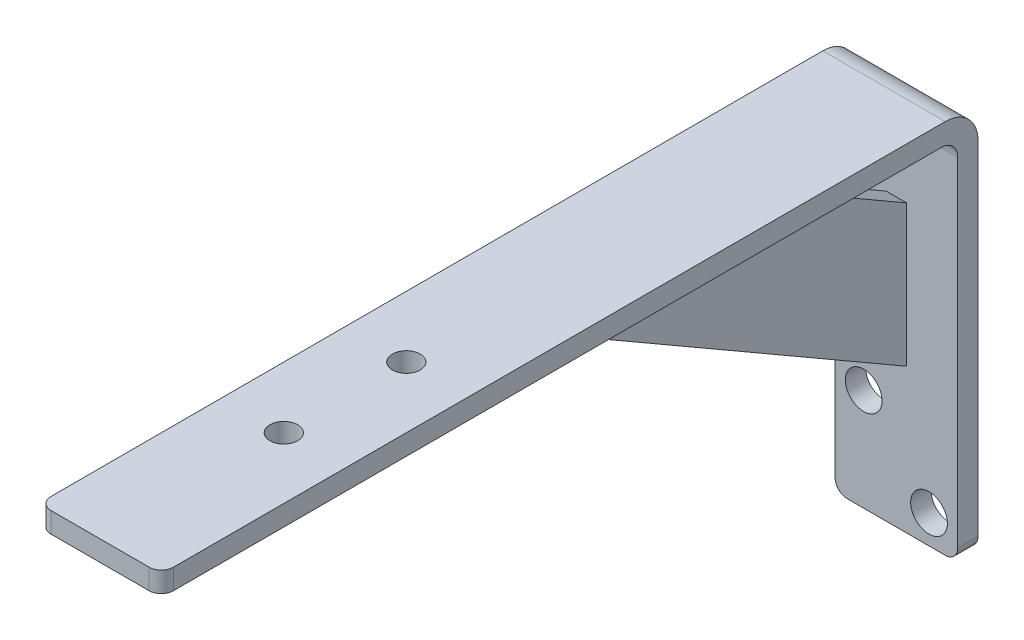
ISO-10303-21;
HEADER;
FILE_DESCRIPTION(('STEP AP214'),'2;1');
FILE_NAME('part.step','',(''),(''),'','','');
FILE_SCHEMA(('AUTOMOTIVE_DESIGN { 1 0 10303 214 1 1 1 1 }'));
ENDSEC;
DATA;
#1=APPLICATION_CONTEXT('core data for automotive mechanical design processes');
#2=APPLICATION_PROTOCOL_DEFINITION('international standard','automotive_design',2000,#1);
#3=PRODUCT_CONTEXT('',#1,'mechanical');
#4=PRODUCT('Part','Part','',(#3));
#5=PRODUCT_RELATED_PRODUCT_CATEGORY('part','',(#4));
#6=PRODUCT_DEFINITION_FORMATION('','',#4);
#7=PRODUCT_DEFINITION_CONTEXT('part definition',#1,'design');
#8=PRODUCT_DEFINITION('design','',#6,#7);
#9=PRODUCT_DEFINITION_SHAPE('','',#8);
#10=(LENGTH_UNIT() NAMED_UNIT(*) SI_UNIT(.MILLI.,.METRE.));
#11=(NAMED_UNIT(*) PLANE_ANGLE_UNIT() SI_UNIT($,.RADIAN.));
#12=(NAMED_UNIT(*) SI_UNIT($,.STERADIAN.) SOLID_ANGLE_UNIT());
#13=UNCERTAINTY_MEASURE_WITH_UNIT(LENGTH_MEASURE(1.E-05),#10,'distance_accuracy_value','');
#14=(GEOMETRIC_REPRESENTATION_CONTEXT(3) GLOBAL_UNCERTAINTY_ASSIGNED_CONTEXT((#13)) GLOBAL_UNIT_ASSIGNED_CONTEXT((#10,
#11,#12)) REPRESENTATION_CONTEXT('',''));
#15=CARTESIAN_POINT('',(0.,0.,0.));
#16=DIRECTION('',(0.,0.,1.));
#17=DIRECTION('',(1.,0.,0.));
#18=AXIS2_PLACEMENT_3D('',#15,#16,#17);
#19=CARTESIAN_POINT('',(30.,5.,195.));
#20=DIRECTION('',(0.,0.,-1.));
#21=DIRECTION('',(-1.,0.,0.));
#22=AXIS2_PLACEMENT_3D('',#19,#20,#21);
#23=PLANE('',#22);
#24=DIRECTION('',(-1.,0.,0.));
#25=VECTOR('',#24,1.);
#26=CARTESIAN_POINT('',(30.,5.,195.));
#27=LINE('',#26,#25);
#28=CARTESIAN_POINT('',(27.,5.,195.));
#29=VERTEX_POINT('',#28);
#30=CARTESIAN_POINT('',(3.,5.,195.));
#31=VERTEX_POINT('',#30);
#32=EDGE_CURVE('E203',#29,#31,#27,.T.);
#33=ORIENTED_EDGE('',*,*,#32,.T.);
#34=DIRECTION('',(0.,-1.,0.));
#35=VECTOR('',#34,1.);
#36=CARTESIAN_POINT('',(3.,5.,195.));
#37=LINE('',#36,#35);
#38=CARTESIAN_POINT('',(3.,0.,195.));
#39=VERTEX_POINT('',#38);
#40=EDGE_CURVE('E253',#31,#39,#37,.T.);
#41=ORIENTED_EDGE('',*,*,#40,.T.);
#42=DIRECTION('',(-1.,0.,0.));
#43=VECTOR('',#42,1.);
#44=CARTESIAN_POINT('',(30.,0.,195.));
#45=LINE('',#44,#43);
#46=CARTESIAN_POINT('',(27.,0.,195.));
#47=VERTEX_POINT('',#46);
#48=EDGE_CURVE('E220',#47,#39,#45,.T.);
#49=ORIENTED_EDGE('',*,*,#48,.F.);
#50=DIRECTION('',(0.,-1.,0.));
#51=VECTOR('',#50,1.);
#52=CARTESIAN_POINT('',(27.,5.,195.));
#53=LINE('',#52,#51);
#54=EDGE_CURVE('E251',#47,#29,#53,.F.);
#55=ORIENTED_EDGE('',*,*,#54,.T.);
#56=EDGE_LOOP('',(#33,#41,#49,#55));
#57=FACE_BOUND('',#56,.T.);
#58=ADVANCED_FACE('F16',(#57),#23,.F.);
#59=CARTESIAN_POINT('',(30.,0.,195.));
#60=DIRECTION('',(0.,1.,0.));
#61=DIRECTION('',(0.,0.,1.));
#62=AXIS2_PLACEMENT_3D('',#59,#60,#61);
#63=PLANE('',#62);
#64=DIRECTION('',(1.,0.,0.));
#65=VECTOR('',#64,1.);
#66=CARTESIAN_POINT('',(12.5,0.,34.6410161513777));
#67=LINE('',#66,#65);
#68=CARTESIAN_POINT('',(12.5,0.,34.6410161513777));
#69=VERTEX_POINT('',#68);
#70=CARTESIAN_POINT('',(17.5,0.,34.6410161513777));
#71=VERTEX_POINT('',#70);
#72=EDGE_CURVE('E141',#69,#71,#67,.T.);
#73=ORIENTED_EDGE('',*,*,#72,.F.);
#74=DIRECTION('',(0.,0.,1.));
#75=VECTOR('',#74,1.);
#76=CARTESIAN_POINT('',(12.5,0.,94.6410161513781));
#77=LINE('',#76,#75);
#78=CARTESIAN_POINT('',(12.5,0.,94.641016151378));
#79=VERTEX_POINT('',#78);
#80=EDGE_CURVE('E135',#69,#79,#77,.T.);
#81=ORIENTED_EDGE('',*,*,#80,.T.);
#82=DIRECTION('',(1.,0.,0.));
#83=VECTOR('',#82,1.);
#84=CARTESIAN_POINT('',(12.5,0.,94.6410161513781));
#85=LINE('',#84,#83);
#86=CARTESIAN_POINT('',(17.5,0.,94.6410161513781));
#87=VERTEX_POINT('',#86);
#88=EDGE_CURVE('E128',#79,#87,#85,.T.);
#89=ORIENTED_EDGE('',*,*,#88,.T.);
#90=DIRECTION('',(0.,0.,1.));
#91=VECTOR('',#90,1.);
#92=CARTESIAN_POINT('',(17.5,0.,94.6410161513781));
#93=LINE('',#92,#91);
#94=EDGE_CURVE('E132',#71,#87,#93,.T.);
#95=ORIENTED_EDGE('',*,*,#94,.F.);
#96=EDGE_LOOP('',(#73,#81,#89,#95));
#97=FACE_BOUND('',#96,.T.);
#98=CARTESIAN_POINT('',(15.,0.,150.));
#99=DIRECTION('',(0.,1.,0.));
#100=DIRECTION('',(0.,0.,1.));
#101=AXIS2_PLACEMENT_3D('',#98,#99,#100);
#102=CIRCLE('',#101,3.4);
#103=CARTESIAN_POINT('',(15.,0.,153.4));
#104=VERTEX_POINT('',#103);
#105=EDGE_CURVE('E186',#104,#104,#102,.T.);
#106=ORIENTED_EDGE('',*,*,#105,.T.);
#107=EDGE_LOOP('',(#106));
#108=FACE_BOUND('',#107,.T.);
#109=CARTESIAN_POINT('',(15.,0.,120.));
#110=DIRECTION('',(0.,1.,0.));
#111=DIRECTION('',(0.,0.,1.));
#112=AXIS2_PLACEMENT_3D('',#109,#110,#111);
#113=CIRCLE('',#112,3.4);
#114=CARTESIAN_POINT('',(15.,0.,123.4));
#115=VERTEX_POINT('',#114);
#116=EDGE_CURVE('E192',#115,#115,#113,.T.);
#117=ORIENTED_EDGE('',*,*,#116,.T.);
#118=EDGE_LOOP('',(#117));
#119=FACE_BOUND('',#118,.T.);
#120=DIRECTION('',(0.,0.,-1.));
#121=VECTOR('',#120,1.);
#122=CARTESIAN_POINT('',(0.,0.,195.));
#123=LINE('',#122,#121);
#124=CARTESIAN_POINT('',(0.,0.,192.));
#125=VERTEX_POINT('',#124);
#126=CARTESIAN_POINT('',(0.,0.,4.));
#127=VERTEX_POINT('',#126);
#128=EDGE_CURVE('E204',#125,#127,#123,.T.);
#129=ORIENTED_EDGE('',*,*,#128,.T.);
#130=DIRECTION('',(-1.,0.,0.));
#131=VECTOR('',#130,1.);
#132=CARTESIAN_POINT('',(30.,0.,4.));
#133=LINE('',#132,#131);
#134=CARTESIAN_POINT('',(30.,0.,4.));
#135=VERTEX_POINT('',#134);
#136=EDGE_CURVE('E268',#127,#135,#133,.F.);
#137=ORIENTED_EDGE('',*,*,#136,.T.);
#138=DIRECTION('',(0.,0.,-1.));
#139=VECTOR('',#138,1.);
#140=CARTESIAN_POINT('',(30.,0.,195.));
#141=LINE('',#140,#139);
#142=CARTESIAN_POINT('',(30.,0.,192.));
#143=VERTEX_POINT('',#142);
#144=EDGE_CURVE('E193',#143,#135,#141,.T.);
#145=ORIENTED_EDGE('',*,*,#144,.F.);
#146=CARTESIAN_POINT('',(27.,0.,192.));
#147=DIRECTION('',(0.,1.,0.));
#148=DIRECTION('',(0.,0.,1.));
#149=AXIS2_PLACEMENT_3D('',#146,#147,#148);
#150=CIRCLE('',#149,3.);
#151=EDGE_CURVE('E256',#143,#47,#150,.F.);
#152=ORIENTED_EDGE('',*,*,#151,.T.);
#153=ORIENTED_EDGE('',*,*,#48,.T.);
#154=CARTESIAN_POINT('',(3.,0.,192.));
#155=DIRECTION('',(0.,1.,0.));
#156=DIRECTION('',(0.,0.,1.));
#157=AXIS2_PLACEMENT_3D('',#154,#155,#156);
#158=CIRCLE('',#157,3.);
#159=EDGE_CURVE('E258',#39,#125,#158,.F.);
#160=ORIENTED_EDGE('',*,*,#159,.T.);
#161=EDGE_LOOP('',(#129,#137,#145,#152,#153,#160));
#162=FACE_BOUND('',#161,.T.);
#163=ADVANCED_FACE('F130',(#97,#108,#119,#162),#63,.F.);
#164=CARTESIAN_POINT('',(30.,0.,0.));
#165=DIRECTION('',(0.,0.,-1.));
#166=DIRECTION('',(0.,1.,0.));
#167=AXIS2_PLACEMENT_3D('',#164,#165,#166);
#168=PLANE('',#167);
#169=DIRECTION('',(1.,0.,0.));
#170=VECTOR('',#169,1.);
#171=CARTESIAN_POINT('',(12.5,-54.6410161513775,0.));
#172=LINE('',#171,#170);
#173=CARTESIAN_POINT('',(12.5,-54.6410161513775,0.));
#174=VERTEX_POINT('',#173);
#175=CARTESIAN_POINT('',(17.5,-54.6410161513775,0.));
#176=VERTEX_POINT('',#175);
#177=EDGE_CURVE('E140',#174,#176,#172,.T.);
#178=ORIENTED_EDGE('',*,*,#177,.F.);
#179=DIRECTION('',(0.,1.,0.));
#180=VECTOR('',#179,1.);
#181=CARTESIAN_POINT('',(12.5,-20.,0.));
#182=LINE('',#181,#180);
#183=CARTESIAN_POINT('',(12.5,-20.,0.));
#184=VERTEX_POINT('',#183);
#185=EDGE_CURVE('E165',#174,#184,#182,.T.);
#186=ORIENTED_EDGE('',*,*,#185,.T.);
#187=DIRECTION('',(1.,0.,0.));
#188=VECTOR('',#187,1.);
#189=CARTESIAN_POINT('',(12.5,-20.,0.));
#190=LINE('',#189,#188);
#191=CARTESIAN_POINT('',(17.5,-20.,0.));
#192=VERTEX_POINT('',#191);
#193=EDGE_CURVE('E167',#184,#192,#190,.T.);
#194=ORIENTED_EDGE('',*,*,#193,.T.);
#195=DIRECTION('',(0.,1.,0.));
#196=VECTOR('',#195,1.);
#197=CARTESIAN_POINT('',(17.5,-20.,0.));
#198=LINE('',#197,#196);
#199=EDGE_CURVE('E154',#176,#192,#198,.T.);
#200=ORIENTED_EDGE('',*,*,#199,.F.);
#201=EDGE_LOOP('',(#178,#186,#194,#200));
#202=FACE_BOUND('',#201,.T.);
#203=CARTESIAN_POINT('',(7.,-65.,0.));
#204=DIRECTION('',(0.,0.,1.));
#205=DIRECTION('',(1.,0.,0.));
#206=AXIS2_PLACEMENT_3D('',#203,#204,#205);
#207=CIRCLE('',#206,4.5);
#208=CARTESIAN_POINT('',(11.5,-65.,0.));
#209=VERTEX_POINT('',#208);
#210=EDGE_CURVE('E174',#209,#209,#207,.T.);
#211=ORIENTED_EDGE('',*,*,#210,.F.);
#212=EDGE_LOOP('',(#211));
#213=FACE_BOUND('',#212,.T.);
#214=CARTESIAN_POINT('',(23.,-83.,0.));
#215=DIRECTION('',(0.,0.,1.));
#216=DIRECTION('',(1.,0.,0.));
#217=AXIS2_PLACEMENT_3D('',#214,#215,#216);
#218=CIRCLE('',#217,4.5);
#219=CARTESIAN_POINT('',(27.5,-83.,0.));
#220=VERTEX_POINT('',#219);
#221=EDGE_CURVE('E180',#220,#220,#218,.T.);
#222=ORIENTED_EDGE('',*,*,#221,.F.);
#223=EDGE_LOOP('',(#222));
#224=FACE_BOUND('',#223,.T.);
#225=DIRECTION('',(0.,-1.,0.));
#226=VECTOR('',#225,1.);
#227=CARTESIAN_POINT('',(30.,0.,0.));
#228=LINE('',#227,#226);
#229=CARTESIAN_POINT('',(30.,-4.,0.));
#230=VERTEX_POINT('',#229);
#231=CARTESIAN_POINT('',(30.,-87.,0.));
#232=VERTEX_POINT('',#231);
#233=EDGE_CURVE('E196',#230,#232,#228,.T.);
#234=ORIENTED_EDGE('',*,*,#233,.F.);
#235=DIRECTION('',(-1.,0.,0.));
#236=VECTOR('',#235,1.);
#237=CARTESIAN_POINT('',(0.,-4.,0.));
#238=LINE('',#237,#236);
#239=CARTESIAN_POINT('',(0.,-4.,0.));
#240=VERTEX_POINT('',#239);
#241=EDGE_CURVE('E265',#230,#240,#238,.T.);
#242=ORIENTED_EDGE('',*,*,#241,.T.);
#243=DIRECTION('',(0.,-1.,0.));
#244=VECTOR('',#243,1.);
#245=CARTESIAN_POINT('',(0.,0.,0.));
#246=LINE('',#245,#244);
#247=CARTESIAN_POINT('',(0.,-87.,0.));
#248=VERTEX_POINT('',#247);
#249=EDGE_CURVE('E207',#240,#248,#246,.T.);
#250=ORIENTED_EDGE('',*,*,#249,.T.);
#251=CARTESIAN_POINT('',(3.,-87.,0.));
#252=DIRECTION('',(0.,0.,-1.));
#253=DIRECTION('',(0.,1.,0.));
#254=AXIS2_PLACEMENT_3D('',#251,#252,#253);
#255=CIRCLE('',#254,3.);
#256=CARTESIAN_POINT('',(3.,-90.,0.));
#257=VERTEX_POINT('',#256);
#258=EDGE_CURVE('E243',#248,#257,#255,.F.);
#259=ORIENTED_EDGE('',*,*,#258,.T.);
#260=DIRECTION('',(-1.,0.,0.));
#261=VECTOR('',#260,1.);
#262=CARTESIAN_POINT('',(30.,-90.,0.));
#263=LINE('',#262,#261);
#264=CARTESIAN_POINT('',(27.,-90.,0.));
#265=VERTEX_POINT('',#264);
#266=EDGE_CURVE('E217',#265,#257,#263,.T.);
#267=ORIENTED_EDGE('',*,*,#266,.F.);
#268=CARTESIAN_POINT('',(27.,-87.,0.));
#269=DIRECTION('',(0.,0.,-1.));
#270=DIRECTION('',(0.,1.,0.));
#271=AXIS2_PLACEMENT_3D('',#268,#269,#270);
#272=CIRCLE('',#271,3.);
#273=EDGE_CURVE('E240',#265,#232,#272,.F.);
#274=ORIENTED_EDGE('',*,*,#273,.T.);
#275=EDGE_LOOP('',(#234,#242,#250,#259,#267,#274));
#276=FACE_BOUND('',#275,.T.);
#277=ADVANCED_FACE('F309',(#202,#213,#224,#276),#168,.F.);
#278=CARTESIAN_POINT('',(30.,-90.,0.));
#279=DIRECTION('',(0.,1.,0.));
#280=DIRECTION('',(0.,0.,1.));
#281=AXIS2_PLACEMENT_3D('',#278,#279,#280);
#282=PLANE('',#281);
#283=ORIENTED_EDGE('',*,*,#266,.T.);
#284=DIRECTION('',(0.,0.,-1.));
#285=VECTOR('',#284,1.);
#286=CARTESIAN_POINT('',(3.,-90.,0.));
#287=LINE('',#286,#285);
#288=CARTESIAN_POINT('',(3.,-90.,-5.));
#289=VERTEX_POINT('',#288);
#290=EDGE_CURVE('E227',#257,#289,#287,.T.);
#291=ORIENTED_EDGE('',*,*,#290,.T.);
#292=DIRECTION('',(-1.,0.,0.));
#293=VECTOR('',#292,1.);
#294=CARTESIAN_POINT('',(30.,-90.,-5.));
#295=LINE('',#294,#293);
#296=CARTESIAN_POINT('',(27.,-90.,-5.));
#297=VERTEX_POINT('',#296);
#298=EDGE_CURVE('E214',#297,#289,#295,.T.);
#299=ORIENTED_EDGE('',*,*,#298,.F.);
#300=DIRECTION('',(0.,0.,-1.));
#301=VECTOR('',#300,1.);
#302=CARTESIAN_POINT('',(27.,-90.,0.));
#303=LINE('',#302,#301);
#304=EDGE_CURVE('E223',#297,#265,#303,.F.);
#305=ORIENTED_EDGE('',*,*,#304,.T.);
#306=EDGE_LOOP('',(#283,#291,#299,#305));
#307=FACE_BOUND('',#306,.T.);
#308=ADVANCED_FACE('F320',(#307),#282,.F.);
#309=CARTESIAN_POINT('',(30.,5.,-5.));
#310=DIRECTION('',(0.,0.,1.));
#311=DIRECTION('',(0.,-1.,0.));
#312=AXIS2_PLACEMENT_3D('',#309,#310,#311);
#313=PLANE('',#312);
#314=CARTESIAN_POINT('',(7.,-65.,-5.));
#315=DIRECTION('',(0.,0.,1.));
#316=DIRECTION('',(1.,0.,0.));
#317=AXIS2_PLACEMENT_3D('',#314,#315,#316);
#318=CIRCLE('',#317,4.5);
#319=CARTESIAN_POINT('',(11.5,-65.,-5.));
#320=VERTEX_POINT('',#319);
#321=EDGE_CURVE('E169',#320,#320,#318,.T.);
#322=ORIENTED_EDGE('',*,*,#321,.T.);
#323=EDGE_LOOP('',(#322));
#324=FACE_BOUND('',#323,.T.);
#325=CARTESIAN_POINT('',(23.,-83.,-5.));
#326=DIRECTION('',(0.,0.,1.));
#327=DIRECTION('',(1.,0.,0.));
#328=AXIS2_PLACEMENT_3D('',#325,#326,#327);
#329=CIRCLE('',#328,4.5);
#330=CARTESIAN_POINT('',(27.5,-83.,-5.));
#331=VERTEX_POINT('',#330);
#332=EDGE_CURVE('E177',#331,#331,#329,.T.);
#333=ORIENTED_EDGE('',*,*,#332,.T.);
#334=EDGE_LOOP('',(#333));
#335=FACE_BOUND('',#334,.T.);
#336=DIRECTION('',(0.,1.,0.));
#337=VECTOR('',#336,1.);
#338=CARTESIAN_POINT('',(0.,5.,-5.));
#339=LINE('',#338,#337);
#340=CARTESIAN_POINT('',(0.,-87.,-5.));
#341=VERTEX_POINT('',#340);
#342=CARTESIAN_POINT('',(0.,-3.,-5.));
#343=VERTEX_POINT('',#342);
#344=EDGE_CURVE('E209',#341,#343,#339,.T.);
#345=ORIENTED_EDGE('',*,*,#344,.T.);
#346=DIRECTION('',(-1.,0.,0.));
#347=VECTOR('',#346,1.);
#348=CARTESIAN_POINT('',(30.,-3.,-5.));
#349=LINE('',#348,#347);
#350=CARTESIAN_POINT('',(30.,-3.,-5.));
#351=VERTEX_POINT('',#350);
#352=EDGE_CURVE('E24',#343,#351,#349,.F.);
#353=ORIENTED_EDGE('',*,*,#352,.T.);
#354=DIRECTION('',(0.,1.,0.));
#355=VECTOR('',#354,1.);
#356=CARTESIAN_POINT('',(30.,5.,-5.));
#357=LINE('',#356,#355);
#358=CARTESIAN_POINT('',(30.,-87.,-5.));
#359=VERTEX_POINT('',#358);
#360=EDGE_CURVE('E199',#359,#351,#357,.T.);
#361=ORIENTED_EDGE('',*,*,#360,.F.);
#362=CARTESIAN_POINT('',(27.,-87.,-5.));
#363=DIRECTION('',(0.,0.,1.));
#364=DIRECTION('',(0.,-1.,0.));
#365=AXIS2_PLACEMENT_3D('',#362,#363,#364);
#366=CIRCLE('',#365,3.);
#367=EDGE_CURVE('E230',#359,#297,#366,.F.);
#368=ORIENTED_EDGE('',*,*,#367,.T.);
#369=ORIENTED_EDGE('',*,*,#298,.T.);
#370=CARTESIAN_POINT('',(3.,-87.,-5.));
#371=DIRECTION('',(0.,0.,1.));
#372=DIRECTION('',(0.,-1.,0.));
#373=AXIS2_PLACEMENT_3D('',#370,#371,#372);
#374=CIRCLE('',#373,3.);
#375=EDGE_CURVE('E232',#289,#341,#374,.F.);
#376=ORIENTED_EDGE('',*,*,#375,.T.);
#377=EDGE_LOOP('',(#345,#353,#361,#368,#369,#376));
#378=FACE_BOUND('',#377,.T.);
#379=ADVANCED_FACE('F317',(#324,#335,#378),#313,.F.);
#380=CARTESIAN_POINT('',(30.,5.,195.));
#381=DIRECTION('',(0.,-1.,0.));
#382=DIRECTION('',(0.,0.,-1.));
#383=AXIS2_PLACEMENT_3D('',#380,#381,#382);
#384=PLANE('',#383);
#385=CARTESIAN_POINT('',(15.,5.,150.));
#386=DIRECTION('',(0.,1.,0.));
#387=DIRECTION('',(0.,0.,1.));
#388=AXIS2_PLACEMENT_3D('',#385,#386,#387);
#389=CIRCLE('',#388,3.4);
#390=CARTESIAN_POINT('',(15.,5.,153.4));
#391=VERTEX_POINT('',#390);
#392=EDGE_CURVE('E183',#391,#391,#389,.T.);
#393=ORIENTED_EDGE('',*,*,#392,.F.);
#394=EDGE_LOOP('',(#393));
#395=FACE_BOUND('',#394,.T.);
#396=CARTESIAN_POINT('',(15.,5.,120.));
#397=DIRECTION('',(0.,1.,0.));
#398=DIRECTION('',(0.,0.,1.));
#399=AXIS2_PLACEMENT_3D('',#396,#397,#398);
#400=CIRCLE('',#399,3.4);
#401=CARTESIAN_POINT('',(15.,5.,123.4));
#402=VERTEX_POINT('',#401);
#403=EDGE_CURVE('E189',#402,#402,#400,.T.);
#404=ORIENTED_EDGE('',*,*,#403,.F.);
#405=EDGE_LOOP('',(#404));
#406=FACE_BOUND('',#405,.T.);
#407=DIRECTION('',(0.,0.,1.));
#408=VECTOR('',#407,1.);
#409=CARTESIAN_POINT('',(30.,5.,195.));
#410=LINE('',#409,#408);
#411=CARTESIAN_POINT('',(30.,5.,3.));
#412=VERTEX_POINT('',#411);
#413=CARTESIAN_POINT('',(30.,5.,192.));
#414=VERTEX_POINT('',#413);
#415=EDGE_CURVE('E201',#412,#414,#410,.T.);
#416=ORIENTED_EDGE('',*,*,#415,.F.);
#417=DIRECTION('',(-1.,0.,0.));
#418=VECTOR('',#417,1.);
#419=CARTESIAN_POINT('',(30.,5.,3.));
#420=LINE('',#419,#418);
#421=CARTESIAN_POINT('',(0.,5.,3.));
#422=VERTEX_POINT('',#421);
#423=EDGE_CURVE('E274',#412,#422,#420,.T.);
#424=ORIENTED_EDGE('',*,*,#423,.T.);
#425=DIRECTION('',(0.,0.,1.));
#426=VECTOR('',#425,1.);
#427=CARTESIAN_POINT('',(0.,5.,195.));
#428=LINE('',#427,#426);
#429=CARTESIAN_POINT('',(0.,5.,192.));
#430=VERTEX_POINT('',#429);
#431=EDGE_CURVE('E197',#422,#430,#428,.T.);
#432=ORIENTED_EDGE('',*,*,#431,.T.);
#433=CARTESIAN_POINT('',(3.,5.,192.));
#434=DIRECTION('',(0.,-1.,0.));
#435=DIRECTION('',(0.,0.,-1.));
#436=AXIS2_PLACEMENT_3D('',#433,#434,#435);
#437=CIRCLE('',#436,3.);
#438=EDGE_CURVE('E263',#430,#31,#437,.F.);
#439=ORIENTED_EDGE('',*,*,#438,.T.);
#440=ORIENTED_EDGE('',*,*,#32,.F.);
#441=CARTESIAN_POINT('',(27.,5.,192.));
#442=DIRECTION('',(0.,-1.,0.));
#443=DIRECTION('',(0.,0.,-1.));
#444=AXIS2_PLACEMENT_3D('',#441,#442,#443);
#445=CIRCLE('',#444,3.);
#446=EDGE_CURVE('E260',#29,#414,#445,.F.);
#447=ORIENTED_EDGE('',*,*,#446,.T.);
#448=EDGE_LOOP('',(#416,#424,#432,#439,#440,#447));
#449=FACE_BOUND('',#448,.T.);
#450=ADVANCED_FACE('F280',(#395,#406,#449),#384,.F.);
#451=CARTESIAN_POINT('',(30.,0.,195.));
#452=DIRECTION('',(1.,0.,0.));
#453=DIRECTION('',(0.,0.,-1.));
#454=AXIS2_PLACEMENT_3D('',#451,#452,#453);
#455=PLANE('',#454);
#456=ORIENTED_EDGE('',*,*,#360,.T.);
#457=CARTESIAN_POINT('',(30.,-3.,3.));
#458=DIRECTION('',(1.,0.,0.));
#459=DIRECTION('',(0.,0.,-1.));
#460=AXIS2_PLACEMENT_3D('',#457,#458,#459);
#461=CIRCLE('',#460,8.);
#462=EDGE_CURVE('E11',#351,#412,#461,.T.);
#463=ORIENTED_EDGE('',*,*,#462,.T.);
#464=ORIENTED_EDGE('',*,*,#415,.T.);
#465=DIRECTION('',(0.,-1.,0.));
#466=VECTOR('',#465,1.);
#467=CARTESIAN_POINT('',(30.,0.,192.));
#468=LINE('',#467,#466);
#469=EDGE_CURVE('E245',#414,#143,#468,.T.);
#470=ORIENTED_EDGE('',*,*,#469,.T.);
#471=ORIENTED_EDGE('',*,*,#144,.T.);
#472=CARTESIAN_POINT('',(30.,-4.,4.));
#473=DIRECTION('',(1.,0.,0.));
#474=DIRECTION('',(0.,0.,-1.));
#475=AXIS2_PLACEMENT_3D('',#472,#473,#474);
#476=CIRCLE('',#475,4.);
#477=EDGE_CURVE('E272',#135,#230,#476,.F.);
#478=ORIENTED_EDGE('',*,*,#477,.T.);
#479=ORIENTED_EDGE('',*,*,#233,.T.);
#480=DIRECTION('',(0.,0.,-1.));
#481=VECTOR('',#480,1.);
#482=CARTESIAN_POINT('',(30.,-87.,-5.));
#483=LINE('',#482,#481);
#484=EDGE_CURVE('E248',#232,#359,#483,.T.);
#485=ORIENTED_EDGE('',*,*,#484,.T.);
#486=EDGE_LOOP('',(#456,#463,#464,#470,#471,#478,#479,#485));
#487=FACE_BOUND('',#486,.T.);
#488=ADVANCED_FACE('F300',(#487),#455,.T.);
#489=CARTESIAN_POINT('',(0.,0.,195.));
#490=DIRECTION('',(1.,0.,0.));
#491=DIRECTION('',(0.,0.,-1.));
#492=AXIS2_PLACEMENT_3D('',#489,#490,#491);
#493=PLANE('',#492);
#494=ORIENTED_EDGE('',*,*,#431,.F.);
#495=CARTESIAN_POINT('',(0.,-3.,3.));
#496=DIRECTION('',(1.,0.,0.));
#497=DIRECTION('',(0.,0.,-1.));
#498=AXIS2_PLACEMENT_3D('',#495,#496,#497);
#499=CIRCLE('',#498,8.);
#500=EDGE_CURVE('E38',#422,#343,#499,.F.);
#501=ORIENTED_EDGE('',*,*,#500,.T.);
#502=ORIENTED_EDGE('',*,*,#344,.F.);
#503=DIRECTION('',(0.,0.,-1.));
#504=VECTOR('',#503,1.);
#505=CARTESIAN_POINT('',(0.,-87.,195.));
#506=LINE('',#505,#504);
#507=EDGE_CURVE('E237',#341,#248,#506,.F.);
#508=ORIENTED_EDGE('',*,*,#507,.T.);
#509=ORIENTED_EDGE('',*,*,#249,.F.);
#510=CARTESIAN_POINT('',(0.,-4.,4.));
#511=DIRECTION('',(1.,0.,0.));
#512=DIRECTION('',(0.,0.,-1.));
#513=AXIS2_PLACEMENT_3D('',#510,#511,#512);
#514=CIRCLE('',#513,4.);
#515=EDGE_CURVE('E270',#240,#127,#514,.T.);
#516=ORIENTED_EDGE('',*,*,#515,.T.);
#517=ORIENTED_EDGE('',*,*,#128,.F.);
#518=DIRECTION('',(0.,-1.,0.));
#519=VECTOR('',#518,1.);
#520=CARTESIAN_POINT('',(0.,0.,192.));
#521=LINE('',#520,#519);
#522=EDGE_CURVE('E234',#125,#430,#521,.F.);
#523=ORIENTED_EDGE('',*,*,#522,.T.);
#524=EDGE_LOOP('',(#494,#501,#502,#508,#509,#516,#517,#523));
#525=FACE_BOUND('',#524,.T.);
#526=ADVANCED_FACE('F283',(#525),#493,.F.);
#527=CARTESIAN_POINT('',(15.,5.,120.));
#528=DIRECTION('',(0.,1.,0.));
#529=DIRECTION('',(0.,0.,1.));
#530=AXIS2_PLACEMENT_3D('',#527,#528,#529);
#531=CYLINDRICAL_SURFACE('',#530,3.4);
#532=ORIENTED_EDGE('',*,*,#403,.T.);
#533=EDGE_LOOP('',(#532));
#534=FACE_BOUND('',#533,.T.);
#535=ORIENTED_EDGE('',*,*,#116,.F.);
#536=EDGE_LOOP('',(#535));
#537=FACE_BOUND('',#536,.T.);
#538=ADVANCED_FACE('F432',(#534,#537),#531,.F.);
#539=CARTESIAN_POINT('',(15.,5.,150.));
#540=DIRECTION('',(0.,1.,0.));
#541=DIRECTION('',(0.,0.,1.));
#542=AXIS2_PLACEMENT_3D('',#539,#540,#541);
#543=CYLINDRICAL_SURFACE('',#542,3.4);
#544=ORIENTED_EDGE('',*,*,#392,.T.);
#545=EDGE_LOOP('',(#544));
#546=FACE_BOUND('',#545,.T.);
#547=ORIENTED_EDGE('',*,*,#105,.F.);
#548=EDGE_LOOP('',(#547));
#549=FACE_BOUND('',#548,.T.);
#550=ADVANCED_FACE('F424',(#546,#549),#543,.F.);
#551=CARTESIAN_POINT('',(23.,-83.,0.));
#552=DIRECTION('',(0.,0.,1.));
#553=DIRECTION('',(1.,0.,0.));
#554=AXIS2_PLACEMENT_3D('',#551,#552,#553);
#555=CYLINDRICAL_SURFACE('',#554,4.5);
#556=ORIENTED_EDGE('',*,*,#332,.F.);
#557=EDGE_LOOP('',(#556));
#558=FACE_BOUND('',#557,.T.);
#559=ORIENTED_EDGE('',*,*,#221,.T.);
#560=EDGE_LOOP('',(#559));
#561=FACE_BOUND('',#560,.T.);
#562=ADVANCED_FACE('F416',(#558,#561),#555,.F.);
#563=CARTESIAN_POINT('',(7.,-65.,0.));
#564=DIRECTION('',(0.,0.,1.));
#565=DIRECTION('',(1.,0.,0.));
#566=AXIS2_PLACEMENT_3D('',#563,#564,#565);
#567=CYLINDRICAL_SURFACE('',#566,4.5);
#568=ORIENTED_EDGE('',*,*,#321,.F.);
#569=EDGE_LOOP('',(#568));
#570=FACE_BOUND('',#569,.T.);
#571=ORIENTED_EDGE('',*,*,#210,.T.);
#572=EDGE_LOOP('',(#571));
#573=FACE_BOUND('',#572,.T.);
#574=ADVANCED_FACE('F408',(#570,#573),#567,.F.);
#575=CARTESIAN_POINT('',(12.5,0.,34.6410161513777));
#576=DIRECTION('',(0.,0.86602540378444,-0.5));
#577=DIRECTION('',(0.,0.5,0.86602540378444));
#578=AXIS2_PLACEMENT_3D('',#575,#576,#577);
#579=PLANE('',#578);
#580=ORIENTED_EDGE('',*,*,#72,.T.);
#581=DIRECTION('',(0.,0.5,0.86602540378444));
#582=VECTOR('',#581,1.);
#583=CARTESIAN_POINT('',(17.5,0.,34.6410161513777));
#584=LINE('',#583,#582);
#585=EDGE_CURVE('E150',#192,#71,#584,.T.);
#586=ORIENTED_EDGE('',*,*,#585,.F.);
#587=ORIENTED_EDGE('',*,*,#193,.F.);
#588=DIRECTION('',(0.,0.5,0.86602540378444));
#589=VECTOR('',#588,1.);
#590=CARTESIAN_POINT('',(12.5,0.,34.6410161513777));
#591=LINE('',#590,#589);
#592=EDGE_CURVE('E156',#184,#69,#591,.T.);
#593=ORIENTED_EDGE('',*,*,#592,.T.);
#594=EDGE_LOOP('',(#580,#586,#587,#593));
#595=FACE_BOUND('',#594,.T.);
#596=ADVANCED_FACE('F401',(#595),#579,.T.);
#597=CARTESIAN_POINT('',(12.5,0.,94.6410161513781));
#598=DIRECTION('',(0.,-0.86602540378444,0.5));
#599=DIRECTION('',(0.,-0.5,-0.86602540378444));
#600=AXIS2_PLACEMENT_3D('',#597,#598,#599);
#601=PLANE('',#600);
#602=ORIENTED_EDGE('',*,*,#177,.T.);
#603=DIRECTION('',(0.,-0.5,-0.86602540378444));
#604=VECTOR('',#603,1.);
#605=CARTESIAN_POINT('',(17.5,0.,94.6410161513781));
#606=LINE('',#605,#604);
#607=EDGE_CURVE('E148',#87,#176,#606,.T.);
#608=ORIENTED_EDGE('',*,*,#607,.F.);
#609=ORIENTED_EDGE('',*,*,#88,.F.);
#610=DIRECTION('',(0.,-0.5,-0.86602540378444));
#611=VECTOR('',#610,1.);
#612=CARTESIAN_POINT('',(12.5,0.,94.6410161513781));
#613=LINE('',#612,#611);
#614=EDGE_CURVE('E163',#79,#174,#613,.T.);
#615=ORIENTED_EDGE('',*,*,#614,.T.);
#616=EDGE_LOOP('',(#602,#608,#609,#615));
#617=FACE_BOUND('',#616,.T.);
#618=ADVANCED_FACE('F153',(#617),#601,.T.);
#619=CARTESIAN_POINT('',(12.5,-20.,0.));
#620=DIRECTION('',(-1.,0.,0.));
#621=DIRECTION('',(0.,0.,1.));
#622=AXIS2_PLACEMENT_3D('',#619,#620,#621);
#623=PLANE('',#622);
#624=ORIENTED_EDGE('',*,*,#592,.F.);
#625=ORIENTED_EDGE('',*,*,#185,.F.);
#626=ORIENTED_EDGE('',*,*,#614,.F.);
#627=ORIENTED_EDGE('',*,*,#80,.F.);
#628=EDGE_LOOP('',(#624,#625,#626,#627));
#629=FACE_BOUND('',#628,.T.);
#630=ADVANCED_FACE('F386',(#629),#623,.T.);
#631=CARTESIAN_POINT('',(17.5,-20.,0.));
#632=DIRECTION('',(-1.,0.,0.));
#633=DIRECTION('',(0.,0.,1.));
#634=AXIS2_PLACEMENT_3D('',#631,#632,#633);
#635=PLANE('',#634);
#636=ORIENTED_EDGE('',*,*,#585,.T.);
#637=ORIENTED_EDGE('',*,*,#94,.T.);
#638=ORIENTED_EDGE('',*,*,#607,.T.);
#639=ORIENTED_EDGE('',*,*,#199,.T.);
#640=EDGE_LOOP('',(#636,#637,#638,#639));
#641=FACE_BOUND('',#640,.T.);
#642=ADVANCED_FACE('F146',(#641),#635,.F.);
#643=CARTESIAN_POINT('',(3.,-87.,0.));
#644=DIRECTION('',(0.,0.,-1.));
#645=DIRECTION('',(-1.,0.,0.));
#646=AXIS2_PLACEMENT_3D('',#643,#644,#645);
#647=CYLINDRICAL_SURFACE('',#646,3.);
#648=ORIENTED_EDGE('',*,*,#258,.F.);
#649=ORIENTED_EDGE('',*,*,#507,.F.);
#650=ORIENTED_EDGE('',*,*,#375,.F.);
#651=ORIENTED_EDGE('',*,*,#290,.F.);
#652=EDGE_LOOP('',(#648,#649,#650,#651));
#653=FACE_BOUND('',#652,.T.);
#654=ADVANCED_FACE('F324',(#653),#647,.T.);
#655=CARTESIAN_POINT('',(27.,-87.,195.));
#656=DIRECTION('',(0.,0.,1.));
#657=DIRECTION('',(1.,0.,0.));
#658=AXIS2_PLACEMENT_3D('',#655,#656,#657);
#659=CYLINDRICAL_SURFACE('',#658,3.);
#660=ORIENTED_EDGE('',*,*,#273,.F.);
#661=ORIENTED_EDGE('',*,*,#304,.F.);
#662=ORIENTED_EDGE('',*,*,#367,.F.);
#663=ORIENTED_EDGE('',*,*,#484,.F.);
#664=EDGE_LOOP('',(#660,#661,#662,#663));
#665=FACE_BOUND('',#664,.T.);
#666=ADVANCED_FACE('F316',(#665),#659,.T.);
#667=CARTESIAN_POINT('',(3.,5.,192.));
#668=DIRECTION('',(0.,-1.,0.));
#669=DIRECTION('',(0.,0.,-1.));
#670=AXIS2_PLACEMENT_3D('',#667,#668,#669);
#671=CYLINDRICAL_SURFACE('',#670,3.);
#672=ORIENTED_EDGE('',*,*,#438,.F.);
#673=ORIENTED_EDGE('',*,*,#522,.F.);
#674=ORIENTED_EDGE('',*,*,#159,.F.);
#675=ORIENTED_EDGE('',*,*,#40,.F.);
#676=EDGE_LOOP('',(#672,#673,#674,#675));
#677=FACE_BOUND('',#676,.T.);
#678=ADVANCED_FACE('F289',(#677),#671,.T.);
#679=CARTESIAN_POINT('',(27.,0.,192.));
#680=DIRECTION('',(0.,1.,0.));
#681=DIRECTION('',(0.,0.,1.));
#682=AXIS2_PLACEMENT_3D('',#679,#680,#681);
#683=CYLINDRICAL_SURFACE('',#682,3.);
#684=ORIENTED_EDGE('',*,*,#446,.F.);
#685=ORIENTED_EDGE('',*,*,#54,.F.);
#686=ORIENTED_EDGE('',*,*,#151,.F.);
#687=ORIENTED_EDGE('',*,*,#469,.F.);
#688=EDGE_LOOP('',(#684,#685,#686,#687));
#689=FACE_BOUND('',#688,.T.);
#690=ADVANCED_FACE('F296',(#689),#683,.T.);
#691=CARTESIAN_POINT('',(30.,-4.,4.));
#692=DIRECTION('',(1.,0.,0.));
#693=DIRECTION('',(0.,0.,-1.));
#694=AXIS2_PLACEMENT_3D('',#691,#692,#693);
#695=CYLINDRICAL_SURFACE('',#694,4.);
#696=ORIENTED_EDGE('',*,*,#477,.F.);
#697=ORIENTED_EDGE('',*,*,#136,.F.);
#698=ORIENTED_EDGE('',*,*,#515,.F.);
#699=ORIENTED_EDGE('',*,*,#241,.F.);
#700=EDGE_LOOP('',(#696,#697,#698,#699));
#701=FACE_BOUND('',#700,.T.);
#702=ADVANCED_FACE('F305',(#701),#695,.F.);
#703=CARTESIAN_POINT('',(30.,-3.,3.));
#704=DIRECTION('',(-1.,0.,0.));
#705=DIRECTION('',(0.,0.,1.));
#706=AXIS2_PLACEMENT_3D('',#703,#704,#705);
#707=CYLINDRICAL_SURFACE('',#706,8.);
#708=ORIENTED_EDGE('',*,*,#462,.F.);
#709=ORIENTED_EDGE('',*,*,#352,.F.);
#710=ORIENTED_EDGE('',*,*,#500,.F.);
#711=ORIENTED_EDGE('',*,*,#423,.F.);
#712=EDGE_LOOP('',(#708,#709,#710,#711));
#713=FACE_BOUND('',#712,.T.);
#714=ADVANCED_FACE('F18',(#713),#707,.T.);
#715=CLOSED_SHELL('',(#58,#163,#277,#308,#379,#450,#488,#526,#538,#550,#562,#574,#596,#618,#630,
#642,#654,#666,#678,#690,#702,#714));
#716=MANIFOLD_SOLID_BREP('B1',#715);
#717=ADVANCED_BREP_SHAPE_REPRESENTATION('',(#18,#716),#14);
#718=SHAPE_DEFINITION_REPRESENTATION(#9,#717);
ENDSEC;
END-ISO-10303-21;
